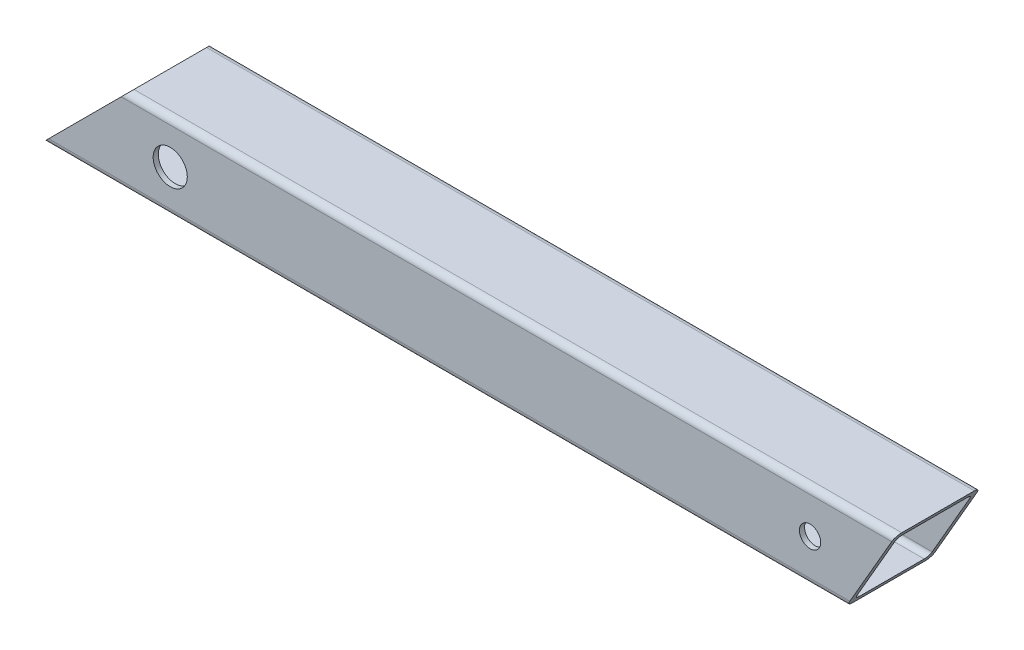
from build123d import *

# Parameters (mm, degrees)
STRUCTURAL_MEMBER1_DEPTH = 1000
CUT_EXTRUDE2_DEPTH       = 1003.496882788
CUT_EXTRUDE2_DEPTH_BACK  = 1003.496882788
CUT_EXTRUDE5_DEPTH       = 1003.496882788
CUT_EXTRUDE5_DEPTH_BACK  = 1003.496882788
SKETCH15_R               = 20
SKETCH15_R_2             = 12.5
CUT_EXTRUDE6_DEPTH       = 1007.230589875


with BuildPart() as part:
    # Sketch1 → Structural Member1 (new body)
    with BuildSketch(Plane(origin=(0, 0, 0), x_dir=(0, 0, -1), z_dir=(1, 0, 0))):
        with BuildLine():
            Line((-42.5, 50), (42.5, 50))
            ThreePointArc((42.5, 50), (47.803300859, 47.803300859), (50, 42.5))
            Line((50, 42.5), (50, -42.5))
            ThreePointArc((50, -42.5), (47.803300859, -47.803300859), (42.5, -50))
            Line((42.5, -50), (-42.5, -50))
            ThreePointArc((-42.5, -50), (-47.803300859, -47.803300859), (-50, -42.5))
            Line((-50, -42.5), (-50, 42.5))
            ThreePointArc((-50, 42.5), (-47.803300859, 47.803300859), (-42.5, 50))
        make_face()
        with BuildLine():
            Line((-38, 44), (38, 44))
            ThreePointArc((38, 44), (42.242640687, 42.242640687), (44, 38))
            Line((44, 38), (44, -38))
            ThreePointArc((44, -38), (42.242640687, -42.242640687), (38, -44))
            Line((38, -44), (-38, -44))
            ThreePointArc((-38, -44), (-42.242640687, -42.242640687), (-44, -38))
            Line((-44, -38), (-44, 38))
            ThreePointArc((-44, 38), (-42.242640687, 42.242640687), (-38, 44))
        make_face(mode=Mode.SUBTRACT)
    extrude(amount=STRUCTURAL_MEMBER1_DEPTH)

    # Sketch13 → Cut-Extrude2 (cut, two sides: drawn at the far end of the back side and taken through both)
    with BuildSketch(Plane.XY.offset(-CUT_EXTRUDE2_DEPTH_BACK)):
        Polygon((-1428.338108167, -1478.338108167), (0, -50), (100, 50), (1528.338108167, 1478.338108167), (-1328.338108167, 4335.014324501), (-4285.014324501, 1378.338108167), align=None)
    extrude(amount=CUT_EXTRUDE2_DEPTH + CUT_EXTRUDE2_DEPTH_BACK, mode=Mode.SUBTRACT)

    # Sketch14 → Cut-Extrude5 (cut, two sides: drawn at the far end of the back side and taken through both)
    with BuildSketch(Plane.XY.offset(-CUT_EXTRUDE5_DEPTH_BACK)):
        Polygon((2009.987562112, 1799.349772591), (1000, 50), (942.264973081, -50), (-67.722589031, -1799.349772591), (3430.97695615, -3819.324896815), (5508.687107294, -220.625351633), align=None)
    extrude(amount=CUT_EXTRUDE5_DEPTH + CUT_EXTRUDE5_DEPTH_BACK, mode=Mode.SUBTRACT)

    # Sketch15 → Cut-Extrude6 (cut, through all)
    with BuildSketch(Plane.XY.offset(50)):
        with Locations((150, 0)):
            Circle(SKETCH15_R)
        with Locations((900, 0)):
            Circle(SKETCH15_R_2)
    extrude(amount=-CUT_EXTRUDE6_DEPTH, mode=Mode.SUBTRACT)


solid = part.part
